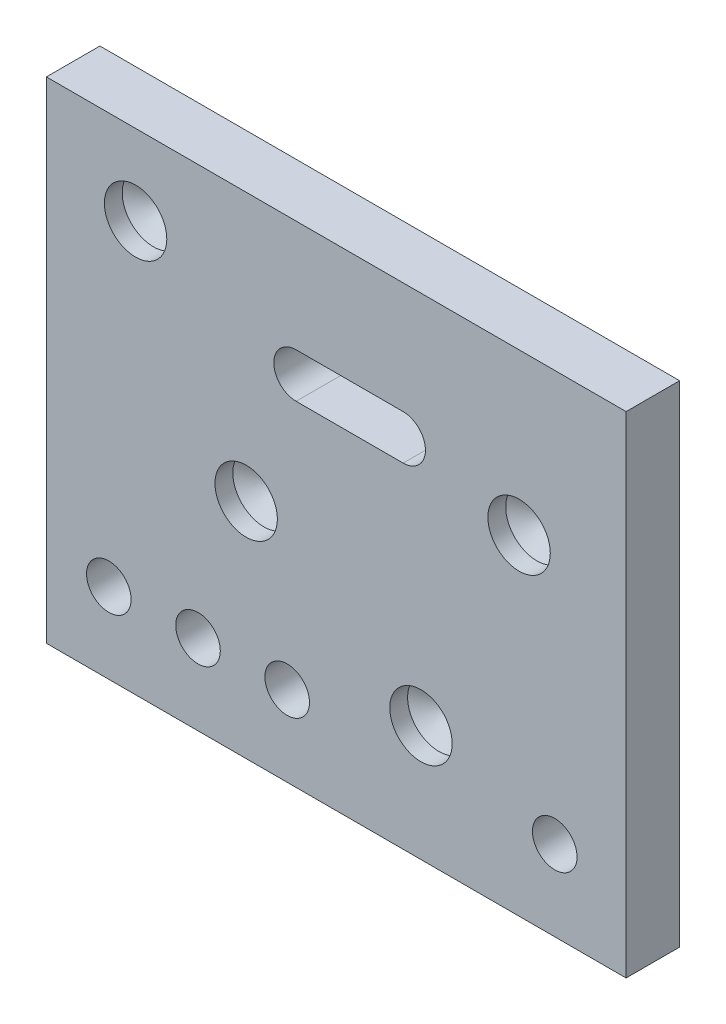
ISO-10303-21;
HEADER;
FILE_DESCRIPTION(('STEP AP214'),'2;1');
FILE_NAME('part.step','',(''),(''),'','','');
FILE_SCHEMA(('AUTOMOTIVE_DESIGN { 1 0 10303 214 1 1 1 1 }'));
ENDSEC;
DATA;
#1=APPLICATION_CONTEXT('core data for automotive mechanical design processes');
#2=APPLICATION_PROTOCOL_DEFINITION('international standard','automotive_design',2000,#1);
#3=PRODUCT_CONTEXT('',#1,'mechanical');
#4=PRODUCT('Part','Part','',(#3));
#5=PRODUCT_RELATED_PRODUCT_CATEGORY('part','',(#4));
#6=PRODUCT_DEFINITION_FORMATION('','',#4);
#7=PRODUCT_DEFINITION_CONTEXT('part definition',#1,'design');
#8=PRODUCT_DEFINITION('design','',#6,#7);
#9=PRODUCT_DEFINITION_SHAPE('','',#8);
#10=(LENGTH_UNIT() NAMED_UNIT(*) SI_UNIT(.MILLI.,.METRE.));
#11=(NAMED_UNIT(*) PLANE_ANGLE_UNIT() SI_UNIT($,.RADIAN.));
#12=(NAMED_UNIT(*) SI_UNIT($,.STERADIAN.) SOLID_ANGLE_UNIT());
#13=UNCERTAINTY_MEASURE_WITH_UNIT(LENGTH_MEASURE(1.E-05),#10,'distance_accuracy_value','');
#14=(GEOMETRIC_REPRESENTATION_CONTEXT(3) GLOBAL_UNCERTAINTY_ASSIGNED_CONTEXT((#13)) GLOBAL_UNIT_ASSIGNED_CONTEXT((#10,
#11,#12)) REPRESENTATION_CONTEXT('',''));
#15=CARTESIAN_POINT('',(0.,0.,0.));
#16=DIRECTION('',(0.,0.,1.));
#17=DIRECTION('',(1.,0.,0.));
#18=AXIS2_PLACEMENT_3D('',#15,#16,#17);
#19=CARTESIAN_POINT('',(0.,275.,0.));
#20=DIRECTION('',(0.,0.,-1.));
#21=DIRECTION('',(-1.,0.,0.));
#22=AXIS2_PLACEMENT_3D('',#19,#20,#21);
#23=PLANE('',#22);
#24=CARTESIAN_POINT('',(140.,200.,0.));
#25=DIRECTION('',(0.,0.,1.));
#26=DIRECTION('',(-1.,0.,0.));
#27=AXIS2_PLACEMENT_3D('',#24,#25,#26);
#28=CIRCLE('',#27,12.5);
#29=CARTESIAN_POINT('',(140.,212.5,0.));
#30=VERTEX_POINT('',#29);
#31=CARTESIAN_POINT('',(140.,187.5,0.));
#32=VERTEX_POINT('',#31);
#33=EDGE_CURVE('E125',#30,#32,#28,.T.);
#34=ORIENTED_EDGE('',*,*,#33,.T.);
#35=DIRECTION('',(1.,0.,0.));
#36=VECTOR('',#35,1.);
#37=CARTESIAN_POINT('',(140.,187.5,0.));
#38=LINE('',#37,#36);
#39=CARTESIAN_POINT('',(200.,187.5,0.));
#40=VERTEX_POINT('',#39);
#41=EDGE_CURVE('E131',#32,#40,#38,.T.);
#42=ORIENTED_EDGE('',*,*,#41,.T.);
#43=CARTESIAN_POINT('',(200.,200.,0.));
#44=DIRECTION('',(0.,0.,1.));
#45=DIRECTION('',(1.,0.,0.));
#46=AXIS2_PLACEMENT_3D('',#43,#44,#45);
#47=CIRCLE('',#46,12.5);
#48=CARTESIAN_POINT('',(200.,212.5,0.));
#49=VERTEX_POINT('',#48);
#50=EDGE_CURVE('E43',#40,#49,#47,.T.);
#51=ORIENTED_EDGE('',*,*,#50,.T.);
#52=DIRECTION('',(-1.,0.,0.));
#53=VECTOR('',#52,1.);
#54=CARTESIAN_POINT('',(140.,212.5,0.));
#55=LINE('',#54,#53);
#56=EDGE_CURVE('E134',#49,#30,#55,.T.);
#57=ORIENTED_EDGE('',*,*,#56,.T.);
#58=EDGE_LOOP('',(#34,#42,#51,#57));
#59=FACE_BOUND('',#58,.T.);
#60=CARTESIAN_POINT('',(85.,45.,0.));
#61=DIRECTION('',(0.,0.,1.));
#62=DIRECTION('',(1.,0.,0.));
#63=AXIS2_PLACEMENT_3D('',#60,#61,#62);
#64=CIRCLE('',#63,12.5);
#65=CARTESIAN_POINT('',(97.5,45.,0.));
#66=VERTEX_POINT('',#65);
#67=EDGE_CURVE('E165',#66,#66,#64,.T.);
#68=ORIENTED_EDGE('',*,*,#67,.T.);
#69=EDGE_LOOP('',(#68));
#70=FACE_BOUND('',#69,.T.);
#71=DIRECTION('',(0.,-1.,0.));
#72=VECTOR('',#71,1.);
#73=CARTESIAN_POINT('',(0.,0.,0.));
#74=LINE('',#73,#72);
#75=CARTESIAN_POINT('',(0.,275.,0.));
#76=VERTEX_POINT('',#75);
#77=CARTESIAN_POINT('',(0.,0.,0.));
#78=VERTEX_POINT('',#77);
#79=EDGE_CURVE('E177',#76,#78,#74,.T.);
#80=ORIENTED_EDGE('',*,*,#79,.F.);
#81=DIRECTION('',(-1.,0.,0.));
#82=VECTOR('',#81,1.);
#83=CARTESIAN_POINT('',(0.,275.,0.));
#84=LINE('',#83,#82);
#85=CARTESIAN_POINT('',(325.,275.,0.));
#86=VERTEX_POINT('',#85);
#87=EDGE_CURVE('E184',#86,#76,#84,.T.);
#88=ORIENTED_EDGE('',*,*,#87,.F.);
#89=DIRECTION('',(0.,1.,0.));
#90=VECTOR('',#89,1.);
#91=CARTESIAN_POINT('',(325.,0.,0.));
#92=LINE('',#91,#90);
#93=CARTESIAN_POINT('',(325.,0.,0.));
#94=VERTEX_POINT('',#93);
#95=EDGE_CURVE('E182',#94,#86,#92,.T.);
#96=ORIENTED_EDGE('',*,*,#95,.F.);
#97=DIRECTION('',(1.,0.,0.));
#98=VECTOR('',#97,1.);
#99=CARTESIAN_POINT('',(0.,0.,0.));
#100=LINE('',#99,#98);
#101=EDGE_CURVE('E180',#78,#94,#100,.T.);
#102=ORIENTED_EDGE('',*,*,#101,.F.);
#103=EDGE_LOOP('',(#80,#88,#96,#102));
#104=FACE_BOUND('',#103,.T.);
#105=CARTESIAN_POINT('',(35.,45.,0.));
#106=DIRECTION('',(0.,0.,1.));
#107=DIRECTION('',(1.,0.,0.));
#108=AXIS2_PLACEMENT_3D('',#105,#106,#107);
#109=CIRCLE('',#108,12.5);
#110=CARTESIAN_POINT('',(47.5,45.,0.));
#111=VERTEX_POINT('',#110);
#112=EDGE_CURVE('E171',#111,#111,#109,.T.);
#113=ORIENTED_EDGE('',*,*,#112,.T.);
#114=EDGE_LOOP('',(#113));
#115=FACE_BOUND('',#114,.T.);
#116=CARTESIAN_POINT('',(135.,45.,0.));
#117=DIRECTION('',(0.,0.,1.));
#118=DIRECTION('',(1.,0.,0.));
#119=AXIS2_PLACEMENT_3D('',#116,#117,#118);
#120=CIRCLE('',#119,12.5);
#121=CARTESIAN_POINT('',(147.5,45.,0.));
#122=VERTEX_POINT('',#121);
#123=EDGE_CURVE('E207',#122,#122,#120,.T.);
#124=ORIENTED_EDGE('',*,*,#123,.T.);
#125=EDGE_LOOP('',(#124));
#126=FACE_BOUND('',#125,.T.);
#127=CARTESIAN_POINT('',(285.,45.,0.));
#128=DIRECTION('',(0.,0.,1.));
#129=DIRECTION('',(1.,0.,0.));
#130=AXIS2_PLACEMENT_3D('',#127,#128,#129);
#131=CIRCLE('',#130,12.5);
#132=CARTESIAN_POINT('',(297.5,45.,0.));
#133=VERTEX_POINT('',#132);
#134=EDGE_CURVE('E36',#133,#133,#131,.T.);
#135=ORIENTED_EDGE('',*,*,#134,.T.);
#136=EDGE_LOOP('',(#135));
#137=FACE_BOUND('',#136,.T.);
#138=ADVANCED_FACE('F28',(#59,#70,#104,#115,#126,#137),#23,.T.);
#139=CARTESIAN_POINT('',(0.,0.,30.));
#140=DIRECTION('',(1.,0.,0.));
#141=DIRECTION('',(0.,0.,-1.));
#142=AXIS2_PLACEMENT_3D('',#139,#140,#141);
#143=PLANE('',#142);
#144=ORIENTED_EDGE('',*,*,#79,.T.);
#145=DIRECTION('',(0.,0.,-1.));
#146=VECTOR('',#145,1.);
#147=CARTESIAN_POINT('',(0.,0.,30.));
#148=LINE('',#147,#146);
#149=CARTESIAN_POINT('',(0.,0.,30.));
#150=VERTEX_POINT('',#149);
#151=EDGE_CURVE('E204',#150,#78,#148,.T.);
#152=ORIENTED_EDGE('',*,*,#151,.F.);
#153=DIRECTION('',(0.,-1.,0.));
#154=VECTOR('',#153,1.);
#155=CARTESIAN_POINT('',(0.,0.,30.));
#156=LINE('',#155,#154);
#157=CARTESIAN_POINT('',(0.,275.,30.));
#158=VERTEX_POINT('',#157);
#159=EDGE_CURVE('E186',#158,#150,#156,.T.);
#160=ORIENTED_EDGE('',*,*,#159,.F.);
#161=DIRECTION('',(0.,0.,-1.));
#162=VECTOR('',#161,1.);
#163=CARTESIAN_POINT('',(0.,275.,30.));
#164=LINE('',#163,#162);
#165=EDGE_CURVE('E195',#158,#76,#164,.T.);
#166=ORIENTED_EDGE('',*,*,#165,.T.);
#167=EDGE_LOOP('',(#144,#152,#160,#166));
#168=FACE_BOUND('',#167,.T.);
#169=ADVANCED_FACE('F239',(#168),#143,.F.);
#170=CARTESIAN_POINT('',(0.,0.,30.));
#171=DIRECTION('',(0.,1.,0.));
#172=DIRECTION('',(0.,0.,1.));
#173=AXIS2_PLACEMENT_3D('',#170,#171,#172);
#174=PLANE('',#173);
#175=ORIENTED_EDGE('',*,*,#101,.T.);
#176=DIRECTION('',(0.,0.,-1.));
#177=VECTOR('',#176,1.);
#178=CARTESIAN_POINT('',(325.,0.,30.));
#179=LINE('',#178,#177);
#180=CARTESIAN_POINT('',(325.,0.,30.));
#181=VERTEX_POINT('',#180);
#182=EDGE_CURVE('E201',#181,#94,#179,.T.);
#183=ORIENTED_EDGE('',*,*,#182,.F.);
#184=DIRECTION('',(1.,0.,0.));
#185=VECTOR('',#184,1.);
#186=CARTESIAN_POINT('',(0.,0.,30.));
#187=LINE('',#186,#185);
#188=EDGE_CURVE('E189',#150,#181,#187,.T.);
#189=ORIENTED_EDGE('',*,*,#188,.F.);
#190=ORIENTED_EDGE('',*,*,#151,.T.);
#191=EDGE_LOOP('',(#175,#183,#189,#190));
#192=FACE_BOUND('',#191,.T.);
#193=ADVANCED_FACE('F245',(#192),#174,.F.);
#194=CARTESIAN_POINT('',(325.,0.,30.));
#195=DIRECTION('',(-1.,0.,0.));
#196=DIRECTION('',(0.,0.,1.));
#197=AXIS2_PLACEMENT_3D('',#194,#195,#196);
#198=PLANE('',#197);
#199=ORIENTED_EDGE('',*,*,#95,.T.);
#200=DIRECTION('',(0.,0.,-1.));
#201=VECTOR('',#200,1.);
#202=CARTESIAN_POINT('',(325.,275.,30.));
#203=LINE('',#202,#201);
#204=CARTESIAN_POINT('',(325.,275.,30.));
#205=VERTEX_POINT('',#204);
#206=EDGE_CURVE('E198',#205,#86,#203,.T.);
#207=ORIENTED_EDGE('',*,*,#206,.F.);
#208=DIRECTION('',(0.,1.,0.));
#209=VECTOR('',#208,1.);
#210=CARTESIAN_POINT('',(325.,0.,30.));
#211=LINE('',#210,#209);
#212=EDGE_CURVE('E191',#181,#205,#211,.T.);
#213=ORIENTED_EDGE('',*,*,#212,.F.);
#214=ORIENTED_EDGE('',*,*,#182,.T.);
#215=EDGE_LOOP('',(#199,#207,#213,#214));
#216=FACE_BOUND('',#215,.T.);
#217=ADVANCED_FACE('F235',(#216),#198,.F.);
#218=CARTESIAN_POINT('',(0.,275.,30.));
#219=DIRECTION('',(0.,-1.,0.));
#220=DIRECTION('',(0.,0.,-1.));
#221=AXIS2_PLACEMENT_3D('',#218,#219,#220);
#222=PLANE('',#221);
#223=ORIENTED_EDGE('',*,*,#87,.T.);
#224=ORIENTED_EDGE('',*,*,#165,.F.);
#225=DIRECTION('',(-1.,0.,0.));
#226=VECTOR('',#225,1.);
#227=CARTESIAN_POINT('',(0.,275.,30.));
#228=LINE('',#227,#226);
#229=EDGE_CURVE('E193',#205,#158,#228,.T.);
#230=ORIENTED_EDGE('',*,*,#229,.F.);
#231=ORIENTED_EDGE('',*,*,#206,.T.);
#232=EDGE_LOOP('',(#223,#224,#230,#231));
#233=FACE_BOUND('',#232,.T.);
#234=ADVANCED_FACE('F224',(#233),#222,.F.);
#235=CARTESIAN_POINT('',(0.,275.,30.));
#236=DIRECTION('',(0.,0.,-1.));
#237=DIRECTION('',(-1.,0.,0.));
#238=AXIS2_PLACEMENT_3D('',#235,#236,#237);
#239=PLANE('',#238);
#240=DIRECTION('',(1.,0.,0.));
#241=VECTOR('',#240,1.);
#242=CARTESIAN_POINT('',(140.,187.5,30.));
#243=LINE('',#242,#241);
#244=CARTESIAN_POINT('',(140.,187.5,30.));
#245=VERTEX_POINT('',#244);
#246=CARTESIAN_POINT('',(200.,187.5,30.));
#247=VERTEX_POINT('',#246);
#248=EDGE_CURVE('E116',#245,#247,#243,.T.);
#249=ORIENTED_EDGE('',*,*,#248,.F.);
#250=CARTESIAN_POINT('',(140.,200.,30.));
#251=DIRECTION('',(0.,0.,1.));
#252=DIRECTION('',(-1.,0.,0.));
#253=AXIS2_PLACEMENT_3D('',#250,#251,#252);
#254=CIRCLE('',#253,12.5);
#255=CARTESIAN_POINT('',(140.,212.5,30.));
#256=VERTEX_POINT('',#255);
#257=EDGE_CURVE('E51',#256,#245,#254,.T.);
#258=ORIENTED_EDGE('',*,*,#257,.F.);
#259=DIRECTION('',(-1.,0.,0.));
#260=VECTOR('',#259,1.);
#261=CARTESIAN_POINT('',(140.,212.5,30.));
#262=LINE('',#261,#260);
#263=CARTESIAN_POINT('',(200.,212.5,30.));
#264=VERTEX_POINT('',#263);
#265=EDGE_CURVE('E123',#264,#256,#262,.T.);
#266=ORIENTED_EDGE('',*,*,#265,.F.);
#267=CARTESIAN_POINT('',(200.,200.,30.));
#268=DIRECTION('',(0.,0.,1.));
#269=DIRECTION('',(1.,0.,0.));
#270=AXIS2_PLACEMENT_3D('',#267,#268,#269);
#271=CIRCLE('',#270,12.5);
#272=EDGE_CURVE('E107',#247,#264,#271,.T.);
#273=ORIENTED_EDGE('',*,*,#272,.F.);
#274=EDGE_LOOP('',(#249,#258,#266,#273));
#275=FACE_BOUND('',#274,.T.);
#276=CARTESIAN_POINT('',(210.,65.,30.));
#277=DIRECTION('',(0.,0.,1.));
#278=DIRECTION('',(1.,0.,0.));
#279=AXIS2_PLACEMENT_3D('',#276,#277,#278);
#280=CIRCLE('',#279,17.5);
#281=CARTESIAN_POINT('',(227.5,65.,30.));
#282=VERTEX_POINT('',#281);
#283=EDGE_CURVE('E144',#282,#282,#280,.T.);
#284=ORIENTED_EDGE('',*,*,#283,.F.);
#285=EDGE_LOOP('',(#284));
#286=FACE_BOUND('',#285,.T.);
#287=CARTESIAN_POINT('',(265.,185.,30.));
#288=DIRECTION('',(0.,0.,1.));
#289=DIRECTION('',(1.,0.,0.));
#290=AXIS2_PLACEMENT_3D('',#287,#288,#289);
#291=CIRCLE('',#290,17.5);
#292=CARTESIAN_POINT('',(282.5,185.,30.));
#293=VERTEX_POINT('',#292);
#294=EDGE_CURVE('E150',#293,#293,#291,.T.);
#295=ORIENTED_EDGE('',*,*,#294,.F.);
#296=EDGE_LOOP('',(#295));
#297=FACE_BOUND('',#296,.T.);
#298=CARTESIAN_POINT('',(112.,125.,30.));
#299=DIRECTION('',(0.,0.,1.));
#300=DIRECTION('',(1.,0.,0.));
#301=AXIS2_PLACEMENT_3D('',#298,#299,#300);
#302=CIRCLE('',#301,17.5);
#303=CARTESIAN_POINT('',(129.5,125.,30.));
#304=VERTEX_POINT('',#303);
#305=EDGE_CURVE('E156',#304,#304,#302,.T.);
#306=ORIENTED_EDGE('',*,*,#305,.F.);
#307=EDGE_LOOP('',(#306));
#308=FACE_BOUND('',#307,.T.);
#309=CARTESIAN_POINT('',(50.,230.,30.));
#310=DIRECTION('',(0.,0.,1.));
#311=DIRECTION('',(1.,0.,0.));
#312=AXIS2_PLACEMENT_3D('',#309,#310,#311);
#313=CIRCLE('',#312,17.5);
#314=CARTESIAN_POINT('',(67.5,230.,30.));
#315=VERTEX_POINT('',#314);
#316=EDGE_CURVE('E162',#315,#315,#313,.T.);
#317=ORIENTED_EDGE('',*,*,#316,.F.);
#318=EDGE_LOOP('',(#317));
#319=FACE_BOUND('',#318,.T.);
#320=CARTESIAN_POINT('',(85.,45.,30.));
#321=DIRECTION('',(0.,0.,1.));
#322=DIRECTION('',(1.,0.,0.));
#323=AXIS2_PLACEMENT_3D('',#320,#321,#322);
#324=CIRCLE('',#323,12.5);
#325=CARTESIAN_POINT('',(97.5,45.,30.));
#326=VERTEX_POINT('',#325);
#327=EDGE_CURVE('E168',#326,#326,#324,.T.);
#328=ORIENTED_EDGE('',*,*,#327,.F.);
#329=EDGE_LOOP('',(#328));
#330=FACE_BOUND('',#329,.T.);
#331=CARTESIAN_POINT('',(35.,45.,30.));
#332=DIRECTION('',(0.,0.,1.));
#333=DIRECTION('',(1.,0.,0.));
#334=AXIS2_PLACEMENT_3D('',#331,#332,#333);
#335=CIRCLE('',#334,12.5);
#336=CARTESIAN_POINT('',(47.5,45.,30.));
#337=VERTEX_POINT('',#336);
#338=EDGE_CURVE('E174',#337,#337,#335,.T.);
#339=ORIENTED_EDGE('',*,*,#338,.F.);
#340=EDGE_LOOP('',(#339));
#341=FACE_BOUND('',#340,.T.);
#342=ORIENTED_EDGE('',*,*,#159,.T.);
#343=ORIENTED_EDGE('',*,*,#188,.T.);
#344=ORIENTED_EDGE('',*,*,#212,.T.);
#345=ORIENTED_EDGE('',*,*,#229,.T.);
#346=EDGE_LOOP('',(#342,#343,#344,#345));
#347=FACE_BOUND('',#346,.T.);
#348=CARTESIAN_POINT('',(135.,45.,30.));
#349=DIRECTION('',(0.,0.,1.));
#350=DIRECTION('',(1.,0.,0.));
#351=AXIS2_PLACEMENT_3D('',#348,#349,#350);
#352=CIRCLE('',#351,12.5);
#353=CARTESIAN_POINT('',(147.5,45.,30.));
#354=VERTEX_POINT('',#353);
#355=EDGE_CURVE('E210',#354,#354,#352,.T.);
#356=ORIENTED_EDGE('',*,*,#355,.F.);
#357=EDGE_LOOP('',(#356));
#358=FACE_BOUND('',#357,.T.);
#359=CARTESIAN_POINT('',(285.,45.,30.));
#360=DIRECTION('',(0.,0.,1.));
#361=DIRECTION('',(1.,0.,0.));
#362=AXIS2_PLACEMENT_3D('',#359,#360,#361);
#363=CIRCLE('',#362,12.5);
#364=CARTESIAN_POINT('',(297.5,45.,30.));
#365=VERTEX_POINT('',#364);
#366=EDGE_CURVE('E11',#365,#365,#363,.T.);
#367=ORIENTED_EDGE('',*,*,#366,.F.);
#368=EDGE_LOOP('',(#367));
#369=FACE_BOUND('',#368,.T.);
#370=ADVANCED_FACE('F120',(#275,#286,#297,#308,#319,#330,#341,#347,#358,#369),#239,.F.);
#371=CARTESIAN_POINT('',(35.,45.,30.));
#372=DIRECTION('',(0.,0.,1.));
#373=DIRECTION('',(1.,0.,0.));
#374=AXIS2_PLACEMENT_3D('',#371,#372,#373);
#375=CYLINDRICAL_SURFACE('',#374,12.5);
#376=ORIENTED_EDGE('',*,*,#112,.F.);
#377=EDGE_LOOP('',(#376));
#378=FACE_BOUND('',#377,.T.);
#379=ORIENTED_EDGE('',*,*,#338,.T.);
#380=EDGE_LOOP('',(#379));
#381=FACE_BOUND('',#380,.T.);
#382=ADVANCED_FACE('F223',(#378,#381),#375,.F.);
#383=CARTESIAN_POINT('',(85.,45.,30.));
#384=DIRECTION('',(0.,0.,1.));
#385=DIRECTION('',(1.,0.,0.));
#386=AXIS2_PLACEMENT_3D('',#383,#384,#385);
#387=CYLINDRICAL_SURFACE('',#386,12.5);
#388=ORIENTED_EDGE('',*,*,#67,.F.);
#389=EDGE_LOOP('',(#388));
#390=FACE_BOUND('',#389,.T.);
#391=ORIENTED_EDGE('',*,*,#327,.T.);
#392=EDGE_LOOP('',(#391));
#393=FACE_BOUND('',#392,.T.);
#394=ADVANCED_FACE('F231',(#390,#393),#387,.F.);
#395=CARTESIAN_POINT('',(135.,45.,30.));
#396=DIRECTION('',(0.,0.,1.));
#397=DIRECTION('',(1.,0.,0.));
#398=AXIS2_PLACEMENT_3D('',#395,#396,#397);
#399=CYLINDRICAL_SURFACE('',#398,12.5);
#400=ORIENTED_EDGE('',*,*,#123,.F.);
#401=EDGE_LOOP('',(#400));
#402=FACE_BOUND('',#401,.T.);
#403=ORIENTED_EDGE('',*,*,#355,.T.);
#404=EDGE_LOOP('',(#403));
#405=FACE_BOUND('',#404,.T.);
#406=ADVANCED_FACE('F219',(#402,#405),#399,.F.);
#407=CARTESIAN_POINT('',(285.,45.,30.));
#408=DIRECTION('',(0.,0.,1.));
#409=DIRECTION('',(1.,0.,0.));
#410=AXIS2_PLACEMENT_3D('',#407,#408,#409);
#411=CYLINDRICAL_SURFACE('',#410,12.5);
#412=ORIENTED_EDGE('',*,*,#134,.F.);
#413=EDGE_LOOP('',(#412));
#414=FACE_BOUND('',#413,.T.);
#415=ORIENTED_EDGE('',*,*,#366,.T.);
#416=EDGE_LOOP('',(#415));
#417=FACE_BOUND('',#416,.T.);
#418=ADVANCED_FACE('F30',(#414,#417),#411,.F.);
#419=CARTESIAN_POINT('',(50.,230.,30.));
#420=DIRECTION('',(0.,0.,1.));
#421=DIRECTION('',(1.,0.,0.));
#422=AXIS2_PLACEMENT_3D('',#419,#420,#421);
#423=CYLINDRICAL_SURFACE('',#422,17.5);
#424=CARTESIAN_POINT('',(50.,230.,20.));
#425=DIRECTION('',(0.,0.,1.));
#426=DIRECTION('',(1.,0.,0.));
#427=AXIS2_PLACEMENT_3D('',#424,#425,#426);
#428=CIRCLE('',#427,17.5);
#429=CARTESIAN_POINT('',(67.5,230.,20.));
#430=VERTEX_POINT('',#429);
#431=EDGE_CURVE('E159',#430,#430,#428,.T.);
#432=ORIENTED_EDGE('',*,*,#431,.F.);
#433=EDGE_LOOP('',(#432));
#434=FACE_BOUND('',#433,.T.);
#435=ORIENTED_EDGE('',*,*,#316,.T.);
#436=EDGE_LOOP('',(#435));
#437=FACE_BOUND('',#436,.T.);
#438=ADVANCED_FACE('F218',(#434,#437),#423,.F.);
#439=CARTESIAN_POINT('',(50.,230.,20.));
#440=DIRECTION('',(0.,0.,1.));
#441=DIRECTION('',(1.,0.,0.));
#442=AXIS2_PLACEMENT_3D('',#439,#440,#441);
#443=CONICAL_SURFACE('',#442,17.5,1.02974425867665);
#444=CARTESIAN_POINT('',(50.,230.,9.48493916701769));
#445=VERTEX_POINT('',#444);
#446=VERTEX_LOOP('',#445);
#447=FACE_BOUND('',#446,.T.);
#448=ORIENTED_EDGE('',*,*,#431,.T.);
#449=EDGE_LOOP('',(#448));
#450=FACE_BOUND('',#449,.T.);
#451=ADVANCED_FACE('F255',(#447,#450),#443,.F.);
#452=CARTESIAN_POINT('',(112.,125.,30.));
#453=DIRECTION('',(0.,0.,1.));
#454=DIRECTION('',(1.,0.,0.));
#455=AXIS2_PLACEMENT_3D('',#452,#453,#454);
#456=CYLINDRICAL_SURFACE('',#455,17.5);
#457=CARTESIAN_POINT('',(112.,125.,20.));
#458=DIRECTION('',(0.,0.,1.));
#459=DIRECTION('',(1.,0.,0.));
#460=AXIS2_PLACEMENT_3D('',#457,#458,#459);
#461=CIRCLE('',#460,17.5);
#462=CARTESIAN_POINT('',(129.5,125.,20.));
#463=VERTEX_POINT('',#462);
#464=EDGE_CURVE('E153',#463,#463,#461,.T.);
#465=ORIENTED_EDGE('',*,*,#464,.F.);
#466=EDGE_LOOP('',(#465));
#467=FACE_BOUND('',#466,.T.);
#468=ORIENTED_EDGE('',*,*,#305,.T.);
#469=EDGE_LOOP('',(#468));
#470=FACE_BOUND('',#469,.T.);
#471=ADVANCED_FACE('F259',(#467,#470),#456,.F.);
#472=CARTESIAN_POINT('',(112.,125.,20.));
#473=DIRECTION('',(0.,0.,1.));
#474=DIRECTION('',(1.,0.,0.));
#475=AXIS2_PLACEMENT_3D('',#472,#473,#474);
#476=CONICAL_SURFACE('',#475,17.5,1.02974425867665);
#477=CARTESIAN_POINT('',(112.,125.,9.48493916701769));
#478=VERTEX_POINT('',#477);
#479=VERTEX_LOOP('',#478);
#480=FACE_BOUND('',#479,.T.);
#481=ORIENTED_EDGE('',*,*,#464,.T.);
#482=EDGE_LOOP('',(#481));
#483=FACE_BOUND('',#482,.T.);
#484=ADVANCED_FACE('F263',(#480,#483),#476,.F.);
#485=CARTESIAN_POINT('',(265.,185.,30.));
#486=DIRECTION('',(0.,0.,1.));
#487=DIRECTION('',(1.,0.,0.));
#488=AXIS2_PLACEMENT_3D('',#485,#486,#487);
#489=CYLINDRICAL_SURFACE('',#488,17.5);
#490=CARTESIAN_POINT('',(265.,185.,20.));
#491=DIRECTION('',(0.,0.,1.));
#492=DIRECTION('',(1.,0.,0.));
#493=AXIS2_PLACEMENT_3D('',#490,#491,#492);
#494=CIRCLE('',#493,17.5);
#495=CARTESIAN_POINT('',(282.5,185.,20.));
#496=VERTEX_POINT('',#495);
#497=EDGE_CURVE('E147',#496,#496,#494,.T.);
#498=ORIENTED_EDGE('',*,*,#497,.F.);
#499=EDGE_LOOP('',(#498));
#500=FACE_BOUND('',#499,.T.);
#501=ORIENTED_EDGE('',*,*,#294,.T.);
#502=EDGE_LOOP('',(#501));
#503=FACE_BOUND('',#502,.T.);
#504=ADVANCED_FACE('F267',(#500,#503),#489,.F.);
#505=CARTESIAN_POINT('',(265.,185.,20.));
#506=DIRECTION('',(0.,0.,1.));
#507=DIRECTION('',(1.,0.,0.));
#508=AXIS2_PLACEMENT_3D('',#505,#506,#507);
#509=CONICAL_SURFACE('',#508,17.5,1.02974425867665);
#510=CARTESIAN_POINT('',(265.,185.,9.48493916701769));
#511=VERTEX_POINT('',#510);
#512=VERTEX_LOOP('',#511);
#513=FACE_BOUND('',#512,.T.);
#514=ORIENTED_EDGE('',*,*,#497,.T.);
#515=EDGE_LOOP('',(#514));
#516=FACE_BOUND('',#515,.T.);
#517=ADVANCED_FACE('F271',(#513,#516),#509,.F.);
#518=CARTESIAN_POINT('',(210.,65.,30.));
#519=DIRECTION('',(0.,0.,1.));
#520=DIRECTION('',(1.,0.,0.));
#521=AXIS2_PLACEMENT_3D('',#518,#519,#520);
#522=CYLINDRICAL_SURFACE('',#521,17.5);
#523=CARTESIAN_POINT('',(210.,65.,20.));
#524=DIRECTION('',(0.,0.,1.));
#525=DIRECTION('',(1.,0.,0.));
#526=AXIS2_PLACEMENT_3D('',#523,#524,#525);
#527=CIRCLE('',#526,17.5);
#528=CARTESIAN_POINT('',(227.5,65.,20.));
#529=VERTEX_POINT('',#528);
#530=EDGE_CURVE('E139',#529,#529,#527,.T.);
#531=ORIENTED_EDGE('',*,*,#530,.F.);
#532=EDGE_LOOP('',(#531));
#533=FACE_BOUND('',#532,.T.);
#534=ORIENTED_EDGE('',*,*,#283,.T.);
#535=EDGE_LOOP('',(#534));
#536=FACE_BOUND('',#535,.T.);
#537=ADVANCED_FACE('F275',(#533,#536),#522,.F.);
#538=CARTESIAN_POINT('',(210.,65.,20.));
#539=DIRECTION('',(0.,0.,1.));
#540=DIRECTION('',(1.,0.,0.));
#541=AXIS2_PLACEMENT_3D('',#538,#539,#540);
#542=CONICAL_SURFACE('',#541,17.5,1.02974425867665);
#543=CARTESIAN_POINT('',(210.,65.,9.48493916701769));
#544=VERTEX_POINT('',#543);
#545=VERTEX_LOOP('',#544);
#546=FACE_BOUND('',#545,.T.);
#547=ORIENTED_EDGE('',*,*,#530,.T.);
#548=EDGE_LOOP('',(#547));
#549=FACE_BOUND('',#548,.T.);
#550=ADVANCED_FACE('F279',(#546,#549),#542,.F.);
#551=CARTESIAN_POINT('',(140.,200.,0.));
#552=DIRECTION('',(0.,0.,1.));
#553=DIRECTION('',(1.,0.,0.));
#554=AXIS2_PLACEMENT_3D('',#551,#552,#553);
#555=CYLINDRICAL_SURFACE('',#554,12.5);
#556=ORIENTED_EDGE('',*,*,#257,.T.);
#557=DIRECTION('',(0.,0.,1.));
#558=VECTOR('',#557,1.);
#559=CARTESIAN_POINT('',(140.,187.5,0.));
#560=LINE('',#559,#558);
#561=EDGE_CURVE('E113',#32,#245,#560,.T.);
#562=ORIENTED_EDGE('',*,*,#561,.F.);
#563=ORIENTED_EDGE('',*,*,#33,.F.);
#564=DIRECTION('',(0.,0.,1.));
#565=VECTOR('',#564,1.);
#566=CARTESIAN_POINT('',(140.,212.5,0.));
#567=LINE('',#566,#565);
#568=EDGE_CURVE('E137',#30,#256,#567,.T.);
#569=ORIENTED_EDGE('',*,*,#568,.T.);
#570=EDGE_LOOP('',(#556,#562,#563,#569));
#571=FACE_BOUND('',#570,.T.);
#572=ADVANCED_FACE('F282',(#571),#555,.F.);
#573=CARTESIAN_POINT('',(140.,212.5,0.));
#574=DIRECTION('',(0.,1.,0.));
#575=DIRECTION('',(0.,0.,1.));
#576=AXIS2_PLACEMENT_3D('',#573,#574,#575);
#577=PLANE('',#576);
#578=ORIENTED_EDGE('',*,*,#265,.T.);
#579=ORIENTED_EDGE('',*,*,#568,.F.);
#580=ORIENTED_EDGE('',*,*,#56,.F.);
#581=DIRECTION('',(0.,0.,1.));
#582=VECTOR('',#581,1.);
#583=CARTESIAN_POINT('',(200.,212.5,0.));
#584=LINE('',#583,#582);
#585=EDGE_CURVE('E112',#49,#264,#584,.T.);
#586=ORIENTED_EDGE('',*,*,#585,.T.);
#587=EDGE_LOOP('',(#578,#579,#580,#586));
#588=FACE_BOUND('',#587,.T.);
#589=ADVANCED_FACE('F285',(#588),#577,.F.);
#590=CARTESIAN_POINT('',(200.,200.,0.));
#591=DIRECTION('',(0.,0.,1.));
#592=DIRECTION('',(1.,0.,0.));
#593=AXIS2_PLACEMENT_3D('',#590,#591,#592);
#594=CYLINDRICAL_SURFACE('',#593,12.5);
#595=ORIENTED_EDGE('',*,*,#272,.T.);
#596=ORIENTED_EDGE('',*,*,#585,.F.);
#597=ORIENTED_EDGE('',*,*,#50,.F.);
#598=DIRECTION('',(0.,0.,1.));
#599=VECTOR('',#598,1.);
#600=CARTESIAN_POINT('',(200.,187.5,0.));
#601=LINE('',#600,#599);
#602=EDGE_CURVE('E103',#40,#247,#601,.T.);
#603=ORIENTED_EDGE('',*,*,#602,.T.);
#604=EDGE_LOOP('',(#595,#596,#597,#603));
#605=FACE_BOUND('',#604,.T.);
#606=ADVANCED_FACE('F105',(#605),#594,.F.);
#607=CARTESIAN_POINT('',(140.,187.5,0.));
#608=DIRECTION('',(0.,-1.,0.));
#609=DIRECTION('',(0.,0.,-1.));
#610=AXIS2_PLACEMENT_3D('',#607,#608,#609);
#611=PLANE('',#610);
#612=ORIENTED_EDGE('',*,*,#248,.T.);
#613=ORIENTED_EDGE('',*,*,#602,.F.);
#614=ORIENTED_EDGE('',*,*,#41,.F.);
#615=ORIENTED_EDGE('',*,*,#561,.T.);
#616=EDGE_LOOP('',(#612,#613,#614,#615));
#617=FACE_BOUND('',#616,.T.);
#618=ADVANCED_FACE('F117',(#617),#611,.F.);
#619=CLOSED_SHELL('',(#138,#169,#193,#217,#234,#370,#382,#394,#406,#418,#438,#451,#471,#484,
#504,#517,#537,#550,#572,#589,#606,#618));
#620=MANIFOLD_SOLID_BREP('B2',#619);
#621=ADVANCED_BREP_SHAPE_REPRESENTATION('',(#18,#620),#14);
#622=SHAPE_DEFINITION_REPRESENTATION(#9,#621);
ENDSEC;
END-ISO-10303-21;
